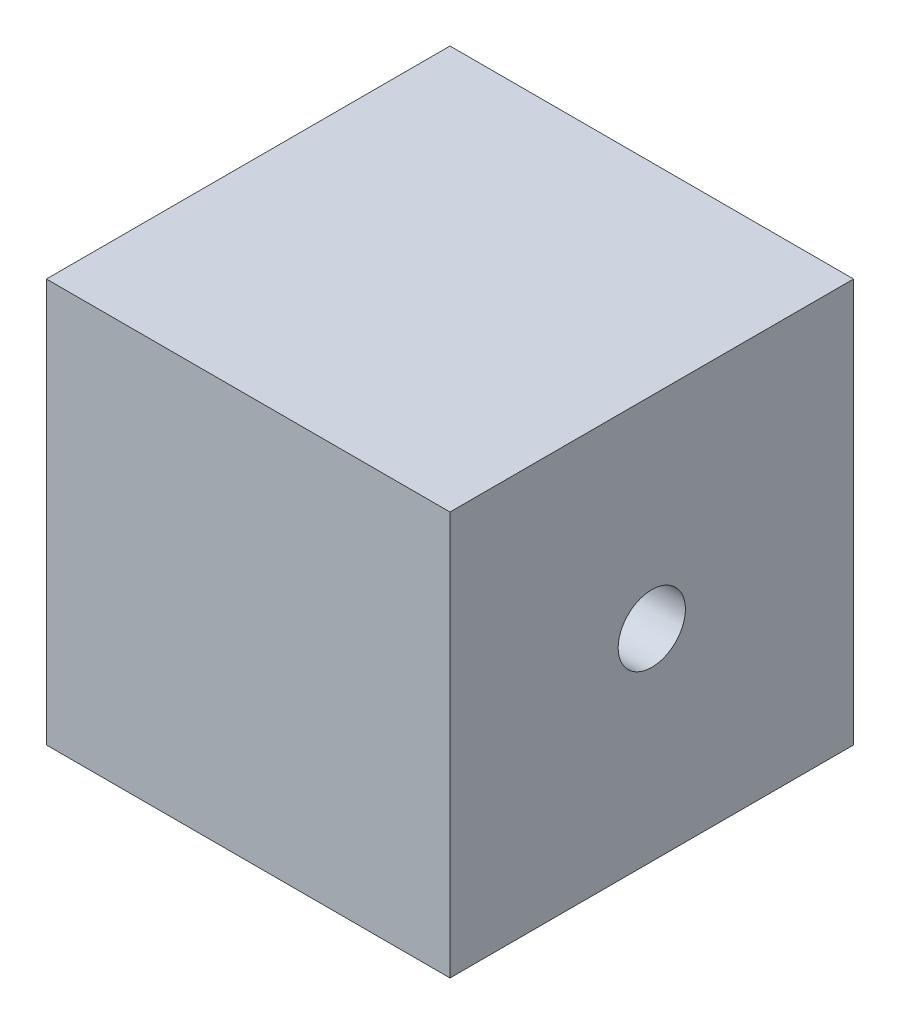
ISO-10303-21;
HEADER;
FILE_DESCRIPTION(('STEP AP214'),'2;1');
FILE_NAME('part.step','',(''),(''),'','','');
FILE_SCHEMA(('AUTOMOTIVE_DESIGN { 1 0 10303 214 1 1 1 1 }'));
ENDSEC;
DATA;
#1=APPLICATION_CONTEXT('core data for automotive mechanical design processes');
#2=APPLICATION_PROTOCOL_DEFINITION('international standard','automotive_design',2000,#1);
#3=PRODUCT_CONTEXT('',#1,'mechanical');
#4=PRODUCT('Part','Part','',(#3));
#5=PRODUCT_RELATED_PRODUCT_CATEGORY('part','',(#4));
#6=PRODUCT_DEFINITION_FORMATION('','',#4);
#7=PRODUCT_DEFINITION_CONTEXT('part definition',#1,'design');
#8=PRODUCT_DEFINITION('design','',#6,#7);
#9=PRODUCT_DEFINITION_SHAPE('','',#8);
#10=(LENGTH_UNIT() NAMED_UNIT(*) SI_UNIT(.MILLI.,.METRE.));
#11=(NAMED_UNIT(*) PLANE_ANGLE_UNIT() SI_UNIT($,.RADIAN.));
#12=(NAMED_UNIT(*) SI_UNIT($,.STERADIAN.) SOLID_ANGLE_UNIT());
#13=UNCERTAINTY_MEASURE_WITH_UNIT(LENGTH_MEASURE(1.E-05),#10,'distance_accuracy_value','');
#14=(GEOMETRIC_REPRESENTATION_CONTEXT(3) GLOBAL_UNCERTAINTY_ASSIGNED_CONTEXT((#13)) GLOBAL_UNIT_ASSIGNED_CONTEXT((#10,
#11,#12)) REPRESENTATION_CONTEXT('',''));
#15=CARTESIAN_POINT('',(0.,0.,0.));
#16=DIRECTION('',(0.,0.,1.));
#17=DIRECTION('',(1.,0.,0.));
#18=AXIS2_PLACEMENT_3D('',#15,#16,#17);
#19=CARTESIAN_POINT('',(-76.2,76.2,-76.2));
#20=DIRECTION('',(1.,0.,0.));
#21=DIRECTION('',(0.,0.,-1.));
#22=AXIS2_PLACEMENT_3D('',#19,#20,#21);
#23=PLANE('',#22);
#24=CARTESIAN_POINT('',(-76.2,0.,0.));
#25=DIRECTION('',(-1.,0.,0.));
#26=DIRECTION('',(0.,0.,1.));
#27=AXIS2_PLACEMENT_3D('',#24,#25,#26);
#28=CIRCLE('',#27,12.7);
#29=CARTESIAN_POINT('',(-76.2,0.,12.7));
#30=VERTEX_POINT('',#29);
#31=EDGE_CURVE('E117',#30,#30,#28,.T.);
#32=ORIENTED_EDGE('',*,*,#31,.F.);
#33=EDGE_LOOP('',(#32));
#34=FACE_BOUND('',#33,.T.);
#35=DIRECTION('',(0.,0.,1.));
#36=VECTOR('',#35,1.);
#37=CARTESIAN_POINT('',(-76.2,-76.2,-76.2));
#38=LINE('',#37,#36);
#39=CARTESIAN_POINT('',(-76.2,-76.2,-76.2));
#40=VERTEX_POINT('',#39);
#41=CARTESIAN_POINT('',(-76.2,-76.2,76.2));
#42=VERTEX_POINT('',#41);
#43=EDGE_CURVE('E97',#40,#42,#38,.T.);
#44=ORIENTED_EDGE('',*,*,#43,.T.);
#45=DIRECTION('',(0.,-1.,0.));
#46=VECTOR('',#45,1.);
#47=CARTESIAN_POINT('',(-76.2,76.2,76.2));
#48=LINE('',#47,#46);
#49=CARTESIAN_POINT('',(-76.2,76.2,76.2));
#50=VERTEX_POINT('',#49);
#51=EDGE_CURVE('E11',#50,#42,#48,.T.);
#52=ORIENTED_EDGE('',*,*,#51,.F.);
#53=DIRECTION('',(0.,0.,1.));
#54=VECTOR('',#53,1.);
#55=CARTESIAN_POINT('',(-76.2,76.2,-76.2));
#56=LINE('',#55,#54);
#57=CARTESIAN_POINT('',(-76.2,76.2,-76.2));
#58=VERTEX_POINT('',#57);
#59=EDGE_CURVE('E85',#58,#50,#56,.T.);
#60=ORIENTED_EDGE('',*,*,#59,.F.);
#61=DIRECTION('',(0.,-1.,0.));
#62=VECTOR('',#61,1.);
#63=CARTESIAN_POINT('',(-76.2,76.2,-76.2));
#64=LINE('',#63,#62);
#65=EDGE_CURVE('E93',#58,#40,#64,.T.);
#66=ORIENTED_EDGE('',*,*,#65,.T.);
#67=EDGE_LOOP('',(#44,#52,#60,#66));
#68=FACE_BOUND('',#67,.T.);
#69=ADVANCED_FACE('F34',(#34,#68),#23,.F.);
#70=CARTESIAN_POINT('',(-76.2,76.2,76.2));
#71=DIRECTION('',(0.,0.,-1.));
#72=DIRECTION('',(-1.,0.,0.));
#73=AXIS2_PLACEMENT_3D('',#70,#71,#72);
#74=PLANE('',#73);
#75=DIRECTION('',(1.,0.,0.));
#76=VECTOR('',#75,1.);
#77=CARTESIAN_POINT('',(-76.2,-76.2,76.2));
#78=LINE('',#77,#76);
#79=CARTESIAN_POINT('',(76.2,-76.2,76.2));
#80=VERTEX_POINT('',#79);
#81=EDGE_CURVE('E89',#42,#80,#78,.T.);
#82=ORIENTED_EDGE('',*,*,#81,.T.);
#83=DIRECTION('',(0.,-1.,0.));
#84=VECTOR('',#83,1.);
#85=CARTESIAN_POINT('',(76.2,76.2,76.2));
#86=LINE('',#85,#84);
#87=CARTESIAN_POINT('',(76.2,76.2,76.2));
#88=VERTEX_POINT('',#87);
#89=EDGE_CURVE('E42',#88,#80,#86,.T.);
#90=ORIENTED_EDGE('',*,*,#89,.F.);
#91=DIRECTION('',(1.,0.,0.));
#92=VECTOR('',#91,1.);
#93=CARTESIAN_POINT('',(-76.2,76.2,76.2));
#94=LINE('',#93,#92);
#95=EDGE_CURVE('E80',#50,#88,#94,.T.);
#96=ORIENTED_EDGE('',*,*,#95,.F.);
#97=ORIENTED_EDGE('',*,*,#51,.T.);
#98=EDGE_LOOP('',(#82,#90,#96,#97));
#99=FACE_BOUND('',#98,.T.);
#100=ADVANCED_FACE('F88',(#99),#74,.F.);
#101=CARTESIAN_POINT('',(76.2,76.2,-76.2));
#102=DIRECTION('',(-1.,0.,0.));
#103=DIRECTION('',(0.,0.,1.));
#104=AXIS2_PLACEMENT_3D('',#101,#102,#103);
#105=PLANE('',#104);
#106=CARTESIAN_POINT('',(76.2,0.,0.));
#107=DIRECTION('',(-1.,0.,0.));
#108=DIRECTION('',(0.,0.,1.));
#109=AXIS2_PLACEMENT_3D('',#106,#107,#108);
#110=CIRCLE('',#109,12.7);
#111=CARTESIAN_POINT('',(76.2,0.,12.7));
#112=VERTEX_POINT('',#111);
#113=EDGE_CURVE('E114',#112,#112,#110,.T.);
#114=ORIENTED_EDGE('',*,*,#113,.T.);
#115=EDGE_LOOP('',(#114));
#116=FACE_BOUND('',#115,.T.);
#117=DIRECTION('',(0.,0.,-1.));
#118=VECTOR('',#117,1.);
#119=CARTESIAN_POINT('',(76.2,-76.2,-76.2));
#120=LINE('',#119,#118);
#121=CARTESIAN_POINT('',(76.2,-76.2,-76.2));
#122=VERTEX_POINT('',#121);
#123=EDGE_CURVE('E67',#80,#122,#120,.T.);
#124=ORIENTED_EDGE('',*,*,#123,.T.);
#125=DIRECTION('',(0.,-1.,0.));
#126=VECTOR('',#125,1.);
#127=CARTESIAN_POINT('',(76.2,76.2,-76.2));
#128=LINE('',#127,#126);
#129=CARTESIAN_POINT('',(76.2,76.2,-76.2));
#130=VERTEX_POINT('',#129);
#131=EDGE_CURVE('E90',#130,#122,#128,.T.);
#132=ORIENTED_EDGE('',*,*,#131,.F.);
#133=DIRECTION('',(0.,0.,-1.));
#134=VECTOR('',#133,1.);
#135=CARTESIAN_POINT('',(76.2,76.2,-76.2));
#136=LINE('',#135,#134);
#137=EDGE_CURVE('E83',#88,#130,#136,.T.);
#138=ORIENTED_EDGE('',*,*,#137,.F.);
#139=ORIENTED_EDGE('',*,*,#89,.T.);
#140=EDGE_LOOP('',(#124,#132,#138,#139));
#141=FACE_BOUND('',#140,.T.);
#142=ADVANCED_FACE('F91',(#116,#141),#105,.F.);
#143=CARTESIAN_POINT('',(-76.2,76.2,-76.2));
#144=DIRECTION('',(0.,0.,1.));
#145=DIRECTION('',(1.,0.,0.));
#146=AXIS2_PLACEMENT_3D('',#143,#144,#145);
#147=PLANE('',#146);
#148=DIRECTION('',(-1.,0.,0.));
#149=VECTOR('',#148,1.);
#150=CARTESIAN_POINT('',(-76.2,-76.2,-76.2));
#151=LINE('',#150,#149);
#152=EDGE_CURVE('E73',#122,#40,#151,.T.);
#153=ORIENTED_EDGE('',*,*,#152,.T.);
#154=ORIENTED_EDGE('',*,*,#65,.F.);
#155=DIRECTION('',(-1.,0.,0.));
#156=VECTOR('',#155,1.);
#157=CARTESIAN_POINT('',(-76.2,76.2,-76.2));
#158=LINE('',#157,#156);
#159=EDGE_CURVE('E50',#130,#58,#158,.T.);
#160=ORIENTED_EDGE('',*,*,#159,.F.);
#161=ORIENTED_EDGE('',*,*,#131,.T.);
#162=EDGE_LOOP('',(#153,#154,#160,#161));
#163=FACE_BOUND('',#162,.T.);
#164=ADVANCED_FACE('F105',(#163),#147,.F.);
#165=CARTESIAN_POINT('',(0.,76.2,0.));
#166=DIRECTION('',(0.,1.,0.));
#167=DIRECTION('',(0.,0.,1.));
#168=AXIS2_PLACEMENT_3D('',#165,#166,#167);
#169=PLANE('',#168);
#170=ORIENTED_EDGE('',*,*,#59,.T.);
#171=ORIENTED_EDGE('',*,*,#95,.T.);
#172=ORIENTED_EDGE('',*,*,#137,.T.);
#173=ORIENTED_EDGE('',*,*,#159,.T.);
#174=EDGE_LOOP('',(#170,#171,#172,#173));
#175=FACE_BOUND('',#174,.T.);
#176=ADVANCED_FACE('F81',(#175),#169,.T.);
#177=CARTESIAN_POINT('',(0.,-76.2,0.));
#178=DIRECTION('',(0.,1.,0.));
#179=DIRECTION('',(0.,0.,1.));
#180=AXIS2_PLACEMENT_3D('',#177,#178,#179);
#181=PLANE('',#180);
#182=CARTESIAN_POINT('',(0.,-76.2,0.));
#183=DIRECTION('',(0.,-1.,0.));
#184=DIRECTION('',(0.,0.,-1.));
#185=AXIS2_PLACEMENT_3D('',#182,#183,#184);
#186=CIRCLE('',#185,12.7);
#187=CARTESIAN_POINT('',(0.,-76.2,-12.7));
#188=VERTEX_POINT('',#187);
#189=EDGE_CURVE('E111',#188,#188,#186,.T.);
#190=ORIENTED_EDGE('',*,*,#189,.F.);
#191=EDGE_LOOP('',(#190));
#192=FACE_BOUND('',#191,.T.);
#193=ORIENTED_EDGE('',*,*,#43,.F.);
#194=ORIENTED_EDGE('',*,*,#152,.F.);
#195=ORIENTED_EDGE('',*,*,#123,.F.);
#196=ORIENTED_EDGE('',*,*,#81,.F.);
#197=EDGE_LOOP('',(#193,#194,#195,#196));
#198=FACE_BOUND('',#197,.T.);
#199=ADVANCED_FACE('F108',(#192,#198),#181,.F.);
#200=CARTESIAN_POINT('',(0.,-25.4,0.));
#201=DIRECTION('',(0.,-1.,0.));
#202=DIRECTION('',(0.,0.,-1.));
#203=AXIS2_PLACEMENT_3D('',#200,#201,#202);
#204=CYLINDRICAL_SURFACE('',#203,12.7);
#205=CARTESIAN_POINT('',(0.,-25.4,0.));
#206=DIRECTION('',(0.,-1.,0.));
#207=DIRECTION('',(0.,0.,-1.));
#208=AXIS2_PLACEMENT_3D('',#205,#206,#207);
#209=CIRCLE('',#208,12.7);
#210=CARTESIAN_POINT('',(0.,-25.4,-12.7));
#211=VERTEX_POINT('',#210);
#212=EDGE_CURVE('E100',#211,#211,#209,.T.);
#213=ORIENTED_EDGE('',*,*,#212,.F.);
#214=EDGE_LOOP('',(#213));
#215=FACE_BOUND('',#214,.T.);
#216=ORIENTED_EDGE('',*,*,#189,.T.);
#217=EDGE_LOOP('',(#216));
#218=FACE_BOUND('',#217,.T.);
#219=ADVANCED_FACE('F144',(#215,#218),#204,.F.);
#220=CARTESIAN_POINT('',(0.,-25.4,0.));
#221=DIRECTION('',(0.,-1.,0.));
#222=DIRECTION('',(0.,0.,-1.));
#223=AXIS2_PLACEMENT_3D('',#220,#221,#222);
#224=PLANE('',#223);
#225=ORIENTED_EDGE('',*,*,#212,.T.);
#226=EDGE_LOOP('',(#225));
#227=FACE_BOUND('',#226,.T.);
#228=ADVANCED_FACE('F127',(#227),#224,.T.);
#229=CARTESIAN_POINT('',(76.2,0.,0.));
#230=DIRECTION('',(-1.,0.,0.));
#231=DIRECTION('',(0.,0.,1.));
#232=AXIS2_PLACEMENT_3D('',#229,#230,#231);
#233=CYLINDRICAL_SURFACE('',#232,12.7);
#234=CARTESIAN_POINT('',(76.2,0.,12.7));
#235=CARTESIAN_POINT('',(74.6125,0.,12.7));
#236=CARTESIAN_POINT('',(73.025,0.,12.7));
#237=CARTESIAN_POINT('',(69.85,0.,12.7));
#238=CARTESIAN_POINT('',(68.2625,0.,12.7));
#239=CARTESIAN_POINT('',(65.0875,0.,12.7));
#240=CARTESIAN_POINT('',(63.5,0.,12.7));
#241=CARTESIAN_POINT('',(60.325,0.,12.7));
#242=CARTESIAN_POINT('',(58.7375,0.,12.7));
#243=CARTESIAN_POINT('',(55.5625,0.,12.7));
#244=CARTESIAN_POINT('',(53.975,0.,12.7));
#245=CARTESIAN_POINT('',(50.8,0.,12.7));
#246=CARTESIAN_POINT('',(49.2125,0.,12.7));
#247=CARTESIAN_POINT('',(46.0375,0.,12.7));
#248=CARTESIAN_POINT('',(44.45,0.,12.7));
#249=CARTESIAN_POINT('',(41.275,0.,12.7));
#250=CARTESIAN_POINT('',(39.6875,0.,12.7));
#251=CARTESIAN_POINT('',(36.5125,0.,12.7));
#252=CARTESIAN_POINT('',(34.925,0.,12.7));
#253=CARTESIAN_POINT('',(31.75,0.,12.7));
#254=CARTESIAN_POINT('',(30.1625,0.,12.7));
#255=CARTESIAN_POINT('',(26.9875,0.,12.7));
#256=CARTESIAN_POINT('',(25.4,0.,12.7));
#257=CARTESIAN_POINT('',(22.225,0.,12.7));
#258=CARTESIAN_POINT('',(20.6375,0.,12.7));
#259=CARTESIAN_POINT('',(17.4625,0.,12.7));
#260=CARTESIAN_POINT('',(15.875,0.,12.7));
#261=CARTESIAN_POINT('',(12.7,0.,12.7));
#262=CARTESIAN_POINT('',(11.1125,0.,12.7));
#263=CARTESIAN_POINT('',(7.93750000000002,0.,12.7));
#264=CARTESIAN_POINT('',(6.35000000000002,0.,12.7));
#265=CARTESIAN_POINT('',(3.17500000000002,0.,12.7));
#266=CARTESIAN_POINT('',(1.58750000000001,0.,12.7));
#267=CARTESIAN_POINT('',(-1.58749999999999,0.,12.7));
#268=CARTESIAN_POINT('',(-3.17499999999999,0.,12.7));
#269=CARTESIAN_POINT('',(-6.34999999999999,0.,12.7));
#270=CARTESIAN_POINT('',(-7.93749999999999,0.,12.7));
#271=CARTESIAN_POINT('',(-11.1125,0.,12.7));
#272=CARTESIAN_POINT('',(-12.7,0.,12.7));
#273=CARTESIAN_POINT('',(-15.875,0.,12.7));
#274=CARTESIAN_POINT('',(-17.4625,0.,12.7));
#275=CARTESIAN_POINT('',(-20.6375,0.,12.7));
#276=CARTESIAN_POINT('',(-22.225,0.,12.7));
#277=CARTESIAN_POINT('',(-25.4,0.,12.7));
#278=CARTESIAN_POINT('',(-26.9875,0.,12.7));
#279=CARTESIAN_POINT('',(-30.1625,0.,12.7));
#280=CARTESIAN_POINT('',(-31.75,0.,12.7));
#281=CARTESIAN_POINT('',(-34.925,0.,12.7));
#282=CARTESIAN_POINT('',(-36.5125,0.,12.7));
#283=CARTESIAN_POINT('',(-39.6875,0.,12.7));
#284=CARTESIAN_POINT('',(-41.275,0.,12.7));
#285=CARTESIAN_POINT('',(-44.45,0.,12.7));
#286=CARTESIAN_POINT('',(-46.0375,0.,12.7));
#287=CARTESIAN_POINT('',(-49.2125,0.,12.7));
#288=CARTESIAN_POINT('',(-50.8,0.,12.7));
#289=CARTESIAN_POINT('',(-53.975,0.,12.7));
#290=CARTESIAN_POINT('',(-55.5625,0.,12.7));
#291=CARTESIAN_POINT('',(-58.7375,0.,12.7));
#292=CARTESIAN_POINT('',(-60.325,0.,12.7));
#293=CARTESIAN_POINT('',(-63.5,0.,12.7));
#294=CARTESIAN_POINT('',(-65.0875,0.,12.7));
#295=CARTESIAN_POINT('',(-68.2625,0.,12.7));
#296=CARTESIAN_POINT('',(-69.85,0.,12.7));
#297=CARTESIAN_POINT('',(-73.025,0.,12.7));
#298=CARTESIAN_POINT('',(-74.6125,0.,12.7));
#299=CARTESIAN_POINT('',(-76.2,0.,12.7));
#300=B_SPLINE_CURVE_WITH_KNOTS('',3,(#234,#235,#236,#237,#238,#239,#240,#241,#242,#243,#244,
#245,#246,#247,#248,#249,#250,#251,#252,#253,#254,#255,#256,#257,#258,#259,#260,#261,#262,#263,
#264,#265,#266,#267,#268,#269,#270,#271,#272,#273,#274,#275,#276,#277,#278,#279,#280,#281,#282,
#283,#284,#285,#286,#287,#288,#289,#290,#291,#292,#293,#294,#295,#296,#297,#298,#299),
.UNSPECIFIED.,.F.,.F.,(4,2,2,2,2,2,2,2,2,2,2,2,2,2,2,2,2,2,2,2,2,2,2,2,2,2,2,2,2,2,2,2,4),(0.,
4.7625,9.52500000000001,14.2875,19.05,23.8125,28.575,33.3375,38.1,42.8625,47.625,52.3875,57.15,
61.9125,66.675,71.4375,76.2,80.9625,85.725,90.4875,95.25,100.0125,104.775,109.5375,114.3,
119.0625,123.825,128.5875,133.35,138.1125,142.875,147.6375,152.4),.UNSPECIFIED.);
#301=EDGE_CURVE('BSEAM124',#112,#30,#300,.T.);
#302=ORIENTED_EDGE('',*,*,#113,.F.);
#303=ORIENTED_EDGE('',*,*,#31,.T.);
#304=ORIENTED_EDGE('',*,*,#301,.T.);
#305=ORIENTED_EDGE('',*,*,#301,.F.);
#306=EDGE_LOOP('',(#302,#304,#303,#305));
#307=FACE_BOUND('',#306,.T.);
#308=ADVANCED_FACE('F124',(#307),#233,.F.);
#309=CLOSED_SHELL('',(#69,#100,#142,#164,#176,#199,#219,#228,#308));
#310=MANIFOLD_SOLID_BREP('B2',#309);
#311=ADVANCED_BREP_SHAPE_REPRESENTATION('',(#18,#310),#14);
#312=SHAPE_DEFINITION_REPRESENTATION(#9,#311);
ENDSEC;
END-ISO-10303-21;
